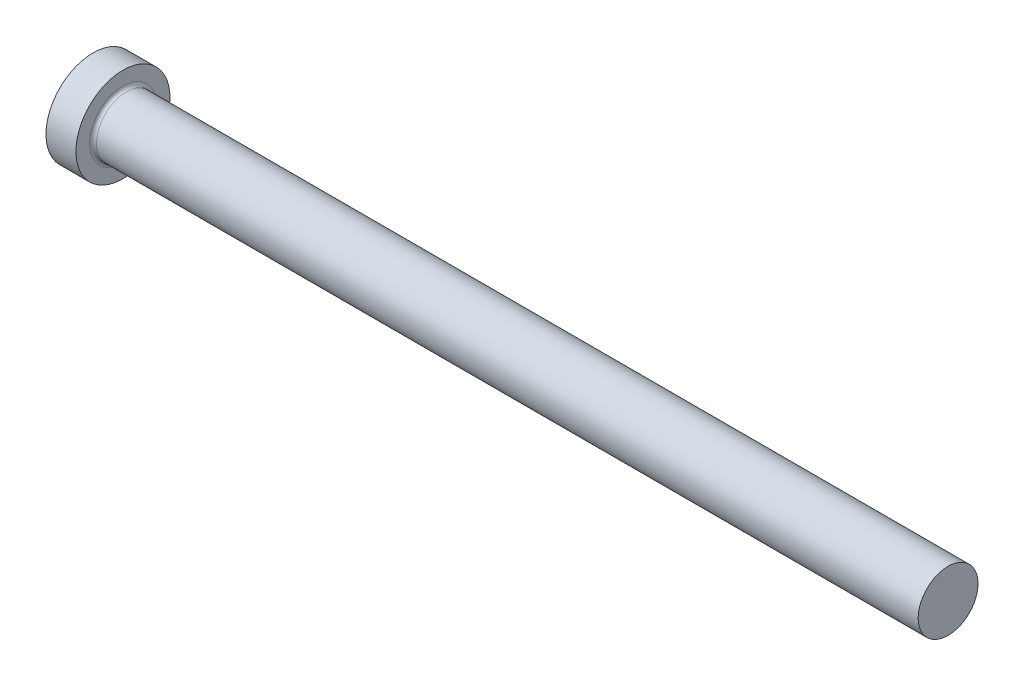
ISO-10303-21;
HEADER;
FILE_DESCRIPTION(('STEP AP214'),'2;1');
FILE_NAME('part.step','',(''),(''),'','','');
FILE_SCHEMA(('AUTOMOTIVE_DESIGN { 1 0 10303 214 1 1 1 1 }'));
ENDSEC;
DATA;
#1=APPLICATION_CONTEXT('core data for automotive mechanical design processes');
#2=APPLICATION_PROTOCOL_DEFINITION('international standard','automotive_design',2000,#1);
#3=PRODUCT_CONTEXT('',#1,'mechanical');
#4=PRODUCT('Part','Part','',(#3));
#5=PRODUCT_RELATED_PRODUCT_CATEGORY('part','',(#4));
#6=PRODUCT_DEFINITION_FORMATION('','',#4);
#7=PRODUCT_DEFINITION_CONTEXT('part definition',#1,'design');
#8=PRODUCT_DEFINITION('design','',#6,#7);
#9=PRODUCT_DEFINITION_SHAPE('','',#8);
#10=(LENGTH_UNIT() NAMED_UNIT(*) SI_UNIT(.MILLI.,.METRE.));
#11=(NAMED_UNIT(*) PLANE_ANGLE_UNIT() SI_UNIT($,.RADIAN.));
#12=(NAMED_UNIT(*) SI_UNIT($,.STERADIAN.) SOLID_ANGLE_UNIT());
#13=UNCERTAINTY_MEASURE_WITH_UNIT(LENGTH_MEASURE(1.E-05),#10,'distance_accuracy_value','');
#14=(GEOMETRIC_REPRESENTATION_CONTEXT(3) GLOBAL_UNCERTAINTY_ASSIGNED_CONTEXT((#13)) GLOBAL_UNIT_ASSIGNED_CONTEXT((#10,
#11,#12)) REPRESENTATION_CONTEXT('',''));
#15=CARTESIAN_POINT('',(0.,0.,0.));
#16=DIRECTION('',(0.,0.,1.));
#17=DIRECTION('',(1.,0.,0.));
#18=AXIS2_PLACEMENT_3D('',#15,#16,#17);
#19=CARTESIAN_POINT('',(0.,0.,0.));
#20=DIRECTION('',(-1.,0.,0.));
#21=DIRECTION('',(0.,-1.,0.));
#22=AXIS2_PLACEMENT_3D('',#19,#20,#21);
#23=PLANE('',#22);
#24=CARTESIAN_POINT('',(0.,0.,0.));
#25=DIRECTION('',(1.,0.,0.));
#26=DIRECTION('',(0.,1.,0.));
#27=AXIS2_PLACEMENT_3D('',#24,#25,#26);
#28=CIRCLE('',#27,11.);
#29=CARTESIAN_POINT('',(0.,11.,0.));
#30=VERTEX_POINT('',#29);
#31=EDGE_CURVE('E25',#30,#30,#28,.T.);
#32=ORIENTED_EDGE('',*,*,#31,.F.);
#33=EDGE_LOOP('',(#32));
#34=FACE_BOUND('',#33,.T.);
#35=ADVANCED_FACE('F14',(#34),#23,.T.);
#36=CARTESIAN_POINT('',(200.,0.,0.));
#37=DIRECTION('',(1.,0.,0.));
#38=DIRECTION('',(0.,1.,0.));
#39=AXIS2_PLACEMENT_3D('',#36,#37,#38);
#40=CYLINDRICAL_SURFACE('',#39,11.);
#41=ORIENTED_EDGE('',*,*,#31,.T.);
#42=EDGE_LOOP('',(#41));
#43=FACE_BOUND('',#42,.T.);
#44=CARTESIAN_POINT('',(7.,0.,0.));
#45=DIRECTION('',(1.,0.,0.));
#46=DIRECTION('',(0.,1.,0.));
#47=AXIS2_PLACEMENT_3D('',#44,#45,#46);
#48=CIRCLE('',#47,11.);
#49=CARTESIAN_POINT('',(7.,11.,0.));
#50=VERTEX_POINT('',#49);
#51=EDGE_CURVE('E29',#50,#50,#48,.T.);
#52=ORIENTED_EDGE('',*,*,#51,.F.);
#53=EDGE_LOOP('',(#52));
#54=FACE_BOUND('',#53,.T.);
#55=ADVANCED_FACE('F51',(#43,#54),#40,.T.);
#56=CARTESIAN_POINT('',(7.,11.,0.));
#57=DIRECTION('',(1.,0.,0.));
#58=DIRECTION('',(0.,1.,0.));
#59=AXIS2_PLACEMENT_3D('',#56,#57,#58);
#60=PLANE('',#59);
#61=CARTESIAN_POINT('',(7.,0.,0.));
#62=DIRECTION('',(1.,0.,0.));
#63=DIRECTION('',(0.,1.,0.));
#64=AXIS2_PLACEMENT_3D('',#61,#62,#63);
#65=CIRCLE('',#64,7.8);
#66=CARTESIAN_POINT('',(7.,7.8,0.));
#67=VERTEX_POINT('',#66);
#68=EDGE_CURVE('E9',#67,#67,#65,.F.);
#69=ORIENTED_EDGE('',*,*,#68,.T.);
#70=EDGE_LOOP('',(#69));
#71=FACE_BOUND('',#70,.T.);
#72=ORIENTED_EDGE('',*,*,#51,.T.);
#73=EDGE_LOOP('',(#72));
#74=FACE_BOUND('',#73,.T.);
#75=ADVANCED_FACE('F42',(#71,#74),#60,.T.);
#76=CARTESIAN_POINT('',(200.,0.,0.));
#77=DIRECTION('',(1.,0.,0.));
#78=DIRECTION('',(0.,1.,0.));
#79=AXIS2_PLACEMENT_3D('',#76,#77,#78);
#80=CYLINDRICAL_SURFACE('',#79,7.);
#81=CARTESIAN_POINT('',(7.8,0.,0.));
#82=DIRECTION('',(1.,0.,0.));
#83=DIRECTION('',(0.,1.,0.));
#84=AXIS2_PLACEMENT_3D('',#81,#82,#83);
#85=CIRCLE('',#84,7.);
#86=CARTESIAN_POINT('',(7.8,7.,0.));
#87=VERTEX_POINT('',#86);
#88=EDGE_CURVE('E21',#87,#87,#85,.T.);
#89=ORIENTED_EDGE('',*,*,#88,.T.);
#90=EDGE_LOOP('',(#89));
#91=FACE_BOUND('',#90,.T.);
#92=CARTESIAN_POINT('',(200.,0.,0.));
#93=DIRECTION('',(1.,0.,0.));
#94=DIRECTION('',(0.,1.,0.));
#95=AXIS2_PLACEMENT_3D('',#92,#93,#94);
#96=CIRCLE('',#95,7.);
#97=CARTESIAN_POINT('',(200.,7.00000000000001,0.));
#98=VERTEX_POINT('',#97);
#99=EDGE_CURVE('E34',#98,#98,#96,.T.);
#100=ORIENTED_EDGE('',*,*,#99,.F.);
#101=EDGE_LOOP('',(#100));
#102=FACE_BOUND('',#101,.T.);
#103=ADVANCED_FACE('F40',(#91,#102),#80,.T.);
#104=CARTESIAN_POINT('',(200.,7.,0.));
#105=DIRECTION('',(1.,0.,0.));
#106=DIRECTION('',(0.,1.,0.));
#107=AXIS2_PLACEMENT_3D('',#104,#105,#106);
#108=PLANE('',#107);
#109=ORIENTED_EDGE('',*,*,#99,.T.);
#110=EDGE_LOOP('',(#109));
#111=FACE_BOUND('',#110,.T.);
#112=ADVANCED_FACE('F38',(#111),#108,.T.);
#113=CARTESIAN_POINT('',(7.8,0.,0.));
#114=DIRECTION('',(1.,0.,0.));
#115=DIRECTION('',(0.,1.,0.));
#116=AXIS2_PLACEMENT_3D('',#113,#114,#115);
#117=TOROIDAL_SURFACE('',#116,7.8,0.8);
#118=ORIENTED_EDGE('',*,*,#68,.F.);
#119=EDGE_LOOP('',(#118));
#120=FACE_BOUND('',#119,.T.);
#121=ORIENTED_EDGE('',*,*,#88,.F.);
#122=EDGE_LOOP('',(#121));
#123=FACE_BOUND('',#122,.T.);
#124=ADVANCED_FACE('F16',(#120,#123),#117,.F.);
#125=CLOSED_SHELL('',(#35,#55,#75,#103,#112,#124));
#126=MANIFOLD_SOLID_BREP('B1',#125);
#127=ADVANCED_BREP_SHAPE_REPRESENTATION('',(#18,#126),#14);
#128=SHAPE_DEFINITION_REPRESENTATION(#9,#127);
ENDSEC;
END-ISO-10303-21;
